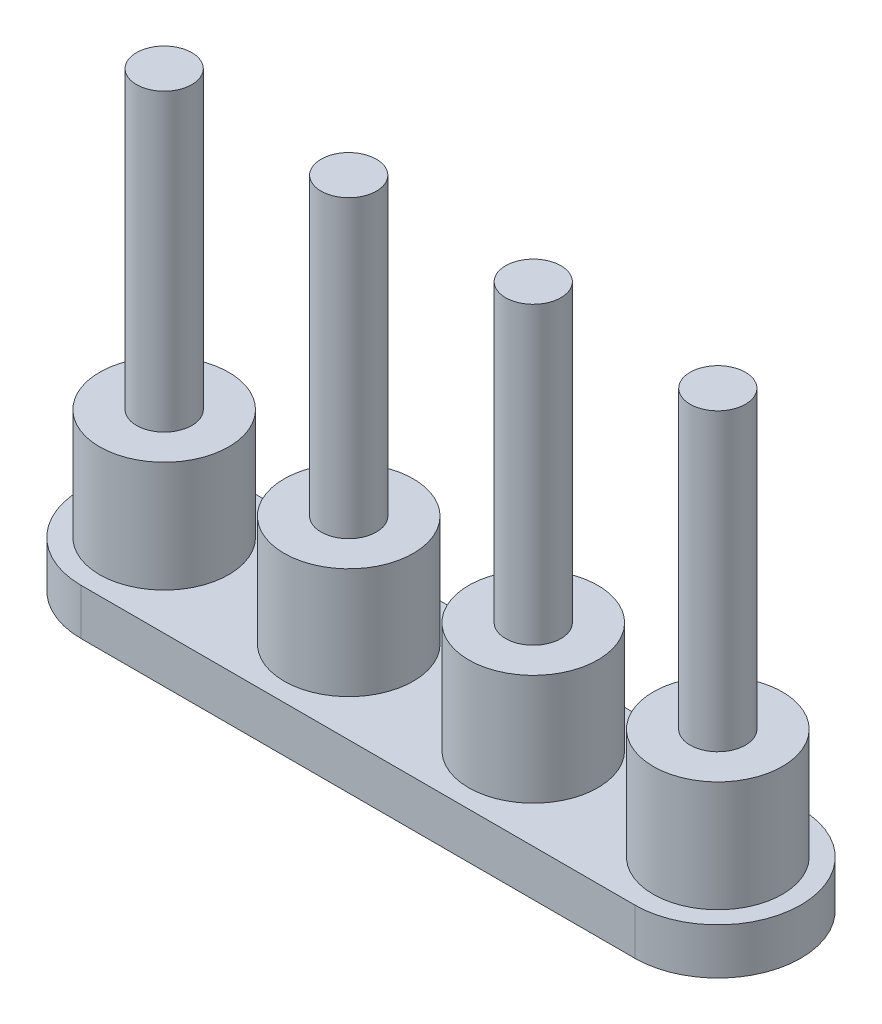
ISO-10303-21;
HEADER;
FILE_DESCRIPTION(('STEP AP214'),'2;1');
FILE_NAME('part.step','',(''),(''),'','','');
FILE_SCHEMA(('AUTOMOTIVE_DESIGN { 1 0 10303 214 1 1 1 1 }'));
ENDSEC;
DATA;
#1=APPLICATION_CONTEXT('core data for automotive mechanical design processes');
#2=APPLICATION_PROTOCOL_DEFINITION('international standard','automotive_design',2000,#1);
#3=PRODUCT_CONTEXT('',#1,'mechanical');
#4=PRODUCT('Part','Part','',(#3));
#5=PRODUCT_RELATED_PRODUCT_CATEGORY('part','',(#4));
#6=PRODUCT_DEFINITION_FORMATION('','',#4);
#7=PRODUCT_DEFINITION_CONTEXT('part definition',#1,'design');
#8=PRODUCT_DEFINITION('design','',#6,#7);
#9=PRODUCT_DEFINITION_SHAPE('','',#8);
#10=(LENGTH_UNIT() NAMED_UNIT(*) SI_UNIT(.MILLI.,.METRE.));
#11=(NAMED_UNIT(*) PLANE_ANGLE_UNIT() SI_UNIT($,.RADIAN.));
#12=(NAMED_UNIT(*) SI_UNIT($,.STERADIAN.) SOLID_ANGLE_UNIT());
#13=UNCERTAINTY_MEASURE_WITH_UNIT(LENGTH_MEASURE(1.E-05),#10,'distance_accuracy_value','');
#14=(GEOMETRIC_REPRESENTATION_CONTEXT(3) GLOBAL_UNCERTAINTY_ASSIGNED_CONTEXT((#13)) GLOBAL_UNIT_ASSIGNED_CONTEXT((#10,
#11,#12)) REPRESENTATION_CONTEXT('',''));
#15=CARTESIAN_POINT('',(0.,0.,0.));
#16=DIRECTION('',(0.,0.,1.));
#17=DIRECTION('',(1.,0.,0.));
#18=AXIS2_PLACEMENT_3D('',#15,#16,#17);
#19=CARTESIAN_POINT('',(15.,8.5,0.));
#20=DIRECTION('',(0.,1.,0.));
#21=DIRECTION('',(0.,0.,1.));
#22=AXIS2_PLACEMENT_3D('',#19,#20,#21);
#23=PLANE('',#22);
#24=CARTESIAN_POINT('',(15.,8.5,0.));
#25=DIRECTION('',(0.,1.,0.));
#26=DIRECTION('',(0.,0.,1.));
#27=AXIS2_PLACEMENT_3D('',#24,#25,#26);
#28=CIRCLE('',#27,3.5);
#29=CARTESIAN_POINT('',(15.,8.5,3.5));
#30=VERTEX_POINT('',#29);
#31=EDGE_CURVE('E155',#30,#30,#28,.T.);
#32=ORIENTED_EDGE('',*,*,#31,.T.);
#33=EDGE_LOOP('',(#32));
#34=FACE_BOUND('',#33,.T.);
#35=CARTESIAN_POINT('',(15.,8.5,0.));
#36=DIRECTION('',(0.,1.,0.));
#37=DIRECTION('',(0.,0.,1.));
#38=AXIS2_PLACEMENT_3D('',#35,#36,#37);
#39=CIRCLE('',#38,1.5);
#40=CARTESIAN_POINT('',(15.,8.5,1.5));
#41=VERTEX_POINT('',#40);
#42=EDGE_CURVE('E112',#41,#41,#39,.T.);
#43=ORIENTED_EDGE('',*,*,#42,.F.);
#44=EDGE_LOOP('',(#43));
#45=FACE_BOUND('',#44,.T.);
#46=ADVANCED_FACE('F33',(#34,#45),#23,.T.);
#47=CARTESIAN_POINT('',(-15.,2.5,-4.5));
#48=DIRECTION('',(0.,0.,1.));
#49=DIRECTION('',(1.,0.,0.));
#50=AXIS2_PLACEMENT_3D('',#47,#48,#49);
#51=PLANE('',#50);
#52=DIRECTION('',(-1.,0.,0.));
#53=VECTOR('',#52,1.);
#54=CARTESIAN_POINT('',(-15.,2.5,-4.5));
#55=LINE('',#54,#53);
#56=CARTESIAN_POINT('',(-2.9999803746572,2.5,-4.5));
#57=VERTEX_POINT('',#56);
#58=CARTESIAN_POINT('',(-15.,2.5,-4.5));
#59=VERTEX_POINT('',#58);
#60=EDGE_CURVE('E48',#57,#59,#55,.T.);
#61=ORIENTED_EDGE('',*,*,#60,.F.);
#62=DIRECTION('',(0.,-1.,0.));
#63=VECTOR('',#62,1.);
#64=CARTESIAN_POINT('',(-2.9999803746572,2.5,-4.5));
#65=LINE('',#64,#63);
#66=CARTESIAN_POINT('',(-2.9999803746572,0.,-4.5));
#67=VERTEX_POINT('',#66);
#68=EDGE_CURVE('E99',#57,#67,#65,.T.);
#69=ORIENTED_EDGE('',*,*,#68,.T.);
#70=DIRECTION('',(-1.,0.,0.));
#71=VECTOR('',#70,1.);
#72=CARTESIAN_POINT('',(-15.,0.,-4.5));
#73=LINE('',#72,#71);
#74=CARTESIAN_POINT('',(-15.,0.,-4.5));
#75=VERTEX_POINT('',#74);
#76=EDGE_CURVE('E88',#67,#75,#73,.T.);
#77=ORIENTED_EDGE('',*,*,#76,.T.);
#78=DIRECTION('',(0.,-1.,0.));
#79=VECTOR('',#78,1.);
#80=CARTESIAN_POINT('',(-15.,2.5,-4.5));
#81=LINE('',#80,#79);
#82=EDGE_CURVE('E171',#59,#75,#81,.T.);
#83=ORIENTED_EDGE('',*,*,#82,.F.);
#84=EDGE_LOOP('',(#61,#69,#77,#83));
#85=FACE_BOUND('',#84,.T.);
#86=ADVANCED_FACE('F100',(#85),#51,.F.);
#87=CARTESIAN_POINT('',(-15.,8.5,0.));
#88=DIRECTION('',(0.,1.,0.));
#89=DIRECTION('',(0.,0.,1.));
#90=AXIS2_PLACEMENT_3D('',#87,#88,#89);
#91=PLANE('',#90);
#92=CARTESIAN_POINT('',(-15.,8.5,0.));
#93=DIRECTION('',(0.,1.,0.));
#94=DIRECTION('',(0.,0.,1.));
#95=AXIS2_PLACEMENT_3D('',#92,#93,#94);
#96=CIRCLE('',#95,3.5);
#97=CARTESIAN_POINT('',(-15.,8.5,3.5));
#98=VERTEX_POINT('',#97);
#99=EDGE_CURVE('E149',#98,#98,#96,.T.);
#100=ORIENTED_EDGE('',*,*,#99,.T.);
#101=EDGE_LOOP('',(#100));
#102=FACE_BOUND('',#101,.T.);
#103=CARTESIAN_POINT('',(-15.,8.5,0.));
#104=DIRECTION('',(0.,1.,0.));
#105=DIRECTION('',(0.,0.,1.));
#106=AXIS2_PLACEMENT_3D('',#103,#104,#105);
#107=CIRCLE('',#106,1.5);
#108=CARTESIAN_POINT('',(-15.,8.5,1.5));
#109=VERTEX_POINT('',#108);
#110=EDGE_CURVE('E104',#109,#109,#107,.T.);
#111=ORIENTED_EDGE('',*,*,#110,.F.);
#112=EDGE_LOOP('',(#111));
#113=FACE_BOUND('',#112,.T.);
#114=ADVANCED_FACE('F205',(#102,#113),#91,.T.);
#115=CARTESIAN_POINT('',(-5.,8.5,0.));
#116=DIRECTION('',(0.,1.,0.));
#117=DIRECTION('',(0.,0.,1.));
#118=AXIS2_PLACEMENT_3D('',#115,#116,#117);
#119=PLANE('',#118);
#120=CARTESIAN_POINT('',(-5.,8.5,0.));
#121=DIRECTION('',(0.,1.,0.));
#122=DIRECTION('',(0.,0.,1.));
#123=AXIS2_PLACEMENT_3D('',#120,#121,#122);
#124=CIRCLE('',#123,3.5);
#125=CARTESIAN_POINT('',(-5.,8.5,3.5));
#126=VERTEX_POINT('',#125);
#127=EDGE_CURVE('E137',#126,#126,#124,.T.);
#128=ORIENTED_EDGE('',*,*,#127,.T.);
#129=EDGE_LOOP('',(#128));
#130=FACE_BOUND('',#129,.T.);
#131=CARTESIAN_POINT('',(-5.,8.5,0.));
#132=DIRECTION('',(0.,1.,0.));
#133=DIRECTION('',(0.,0.,1.));
#134=AXIS2_PLACEMENT_3D('',#131,#132,#133);
#135=CIRCLE('',#134,1.5);
#136=CARTESIAN_POINT('',(-5.,8.5,1.5));
#137=VERTEX_POINT('',#136);
#138=EDGE_CURVE('E122',#137,#137,#135,.T.);
#139=ORIENTED_EDGE('',*,*,#138,.F.);
#140=EDGE_LOOP('',(#139));
#141=FACE_BOUND('',#140,.T.);
#142=ADVANCED_FACE('F369',(#130,#141),#119,.T.);
#143=CARTESIAN_POINT('',(5.,8.5,0.));
#144=DIRECTION('',(0.,1.,0.));
#145=DIRECTION('',(0.,0.,1.));
#146=AXIS2_PLACEMENT_3D('',#143,#144,#145);
#147=PLANE('',#146);
#148=CARTESIAN_POINT('',(5.,8.5,0.));
#149=DIRECTION('',(0.,1.,0.));
#150=DIRECTION('',(0.,0.,1.));
#151=AXIS2_PLACEMENT_3D('',#148,#149,#150);
#152=CIRCLE('',#151,3.5);
#153=CARTESIAN_POINT('',(5.,8.5,3.5));
#154=VERTEX_POINT('',#153);
#155=EDGE_CURVE('E143',#154,#154,#152,.T.);
#156=ORIENTED_EDGE('',*,*,#155,.T.);
#157=EDGE_LOOP('',(#156));
#158=FACE_BOUND('',#157,.T.);
#159=CARTESIAN_POINT('',(5.,8.5,0.));
#160=DIRECTION('',(0.,1.,0.));
#161=DIRECTION('',(0.,0.,1.));
#162=AXIS2_PLACEMENT_3D('',#159,#160,#161);
#163=CIRCLE('',#162,1.5);
#164=CARTESIAN_POINT('',(5.,8.5,1.5));
#165=VERTEX_POINT('',#164);
#166=EDGE_CURVE('E128',#165,#165,#163,.T.);
#167=ORIENTED_EDGE('',*,*,#166,.F.);
#168=EDGE_LOOP('',(#167));
#169=FACE_BOUND('',#168,.T.);
#170=ADVANCED_FACE('F196',(#158,#169),#147,.T.);
#171=CARTESIAN_POINT('',(-15.,2.5,0.));
#172=DIRECTION('',(0.,1.,0.));
#173=DIRECTION('',(0.,0.,1.));
#174=AXIS2_PLACEMENT_3D('',#171,#172,#173);
#175=PLANE('',#174);
#176=CARTESIAN_POINT('',(5.,2.5,0.));
#177=DIRECTION('',(0.,1.,0.));
#178=DIRECTION('',(0.,0.,1.));
#179=AXIS2_PLACEMENT_3D('',#176,#177,#178);
#180=CIRCLE('',#179,3.5);
#181=CARTESIAN_POINT('',(5.,2.5,3.5));
#182=VERTEX_POINT('',#181);
#183=EDGE_CURVE('E140',#182,#182,#180,.T.);
#184=ORIENTED_EDGE('',*,*,#183,.F.);
#185=EDGE_LOOP('',(#184));
#186=FACE_BOUND('',#185,.T.);
#187=CARTESIAN_POINT('',(15.,2.5,0.));
#188=DIRECTION('',(0.,1.,0.));
#189=DIRECTION('',(0.,0.,1.));
#190=AXIS2_PLACEMENT_3D('',#187,#188,#189);
#191=CIRCLE('',#190,3.5);
#192=CARTESIAN_POINT('',(15.,2.5,3.5));
#193=VERTEX_POINT('',#192);
#194=EDGE_CURVE('E152',#193,#193,#191,.T.);
#195=ORIENTED_EDGE('',*,*,#194,.F.);
#196=EDGE_LOOP('',(#195));
#197=FACE_BOUND('',#196,.T.);
#198=CARTESIAN_POINT('',(-15.,2.5,0.));
#199=DIRECTION('',(0.,1.,0.));
#200=DIRECTION('',(0.,0.,1.));
#201=AXIS2_PLACEMENT_3D('',#198,#199,#200);
#202=CIRCLE('',#201,4.5);
#203=CARTESIAN_POINT('',(-15.,2.5,4.5));
#204=VERTEX_POINT('',#203);
#205=EDGE_CURVE('E162',#59,#204,#202,.T.);
#206=ORIENTED_EDGE('',*,*,#205,.T.);
#207=DIRECTION('',(1.,0.,0.));
#208=VECTOR('',#207,1.);
#209=CARTESIAN_POINT('',(-15.,2.5,4.5));
#210=LINE('',#209,#208);
#211=CARTESIAN_POINT('',(15.,2.5,4.5));
#212=VERTEX_POINT('',#211);
#213=EDGE_CURVE('E165',#204,#212,#210,.T.);
#214=ORIENTED_EDGE('',*,*,#213,.T.);
#215=CARTESIAN_POINT('',(15.,2.5,0.));
#216=DIRECTION('',(0.,1.,0.));
#217=DIRECTION('',(0.,0.,-1.));
#218=AXIS2_PLACEMENT_3D('',#215,#216,#217);
#219=CIRCLE('',#218,4.5);
#220=CARTESIAN_POINT('',(15.,2.5,-4.5));
#221=VERTEX_POINT('',#220);
#222=EDGE_CURVE('E167',#212,#221,#219,.T.);
#223=ORIENTED_EDGE('',*,*,#222,.T.);
#224=CARTESIAN_POINT('',(2.9999803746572,2.5,-4.5));
#225=VERTEX_POINT('',#224);
#226=EDGE_CURVE('E169',#221,#225,#55,.T.);
#227=ORIENTED_EDGE('',*,*,#226,.T.);
#228=CARTESIAN_POINT('',(0.,2.5,-4.51085134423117));
#229=DIRECTION('',(0.,-1.,0.));
#230=DIRECTION('',(0.,0.,1.));
#231=AXIS2_PLACEMENT_3D('',#228,#229,#230);
#232=CIRCLE('',#231,3.);
#233=EDGE_CURVE('E107',#57,#225,#232,.T.);
#234=ORIENTED_EDGE('',*,*,#233,.F.);
#235=ORIENTED_EDGE('',*,*,#60,.T.);
#236=EDGE_LOOP('',(#206,#214,#223,#227,#234,#235));
#237=FACE_BOUND('',#236,.T.);
#238=CARTESIAN_POINT('',(-15.,2.5,0.));
#239=DIRECTION('',(0.,1.,0.));
#240=DIRECTION('',(0.,0.,1.));
#241=AXIS2_PLACEMENT_3D('',#238,#239,#240);
#242=CIRCLE('',#241,3.5);
#243=CARTESIAN_POINT('',(-15.,2.5,3.5));
#244=VERTEX_POINT('',#243);
#245=EDGE_CURVE('E146',#244,#244,#242,.T.);
#246=ORIENTED_EDGE('',*,*,#245,.F.);
#247=EDGE_LOOP('',(#246));
#248=FACE_BOUND('',#247,.T.);
#249=CARTESIAN_POINT('',(-5.,2.5,0.));
#250=DIRECTION('',(0.,1.,0.));
#251=DIRECTION('',(0.,0.,1.));
#252=AXIS2_PLACEMENT_3D('',#249,#250,#251);
#253=CIRCLE('',#252,3.5);
#254=CARTESIAN_POINT('',(-5.,2.5,3.5));
#255=VERTEX_POINT('',#254);
#256=EDGE_CURVE('E134',#255,#255,#253,.T.);
#257=ORIENTED_EDGE('',*,*,#256,.F.);
#258=EDGE_LOOP('',(#257));
#259=FACE_BOUND('',#258,.T.);
#260=ADVANCED_FACE('F185',(#186,#197,#237,#248,#259),#175,.T.);
#261=CARTESIAN_POINT('',(-15.,2.5,0.));
#262=DIRECTION('',(0.,-1.,0.));
#263=DIRECTION('',(0.,0.,-1.));
#264=AXIS2_PLACEMENT_3D('',#261,#262,#263);
#265=CYLINDRICAL_SURFACE('',#264,4.5);
#266=CARTESIAN_POINT('',(-15.,0.,0.));
#267=DIRECTION('',(0.,1.,0.));
#268=DIRECTION('',(0.,0.,1.));
#269=AXIS2_PLACEMENT_3D('',#266,#267,#268);
#270=CIRCLE('',#269,4.5);
#271=CARTESIAN_POINT('',(-15.,0.,4.5));
#272=VERTEX_POINT('',#271);
#273=EDGE_CURVE('E94',#75,#272,#270,.T.);
#274=ORIENTED_EDGE('',*,*,#273,.T.);
#275=DIRECTION('',(0.,-1.,0.));
#276=VECTOR('',#275,1.);
#277=CARTESIAN_POINT('',(-15.,2.5,4.5));
#278=LINE('',#277,#276);
#279=EDGE_CURVE('E11',#204,#272,#278,.T.);
#280=ORIENTED_EDGE('',*,*,#279,.F.);
#281=ORIENTED_EDGE('',*,*,#205,.F.);
#282=ORIENTED_EDGE('',*,*,#82,.T.);
#283=EDGE_LOOP('',(#274,#280,#281,#282));
#284=FACE_BOUND('',#283,.T.);
#285=ADVANCED_FACE('F35',(#284),#265,.T.);
#286=CARTESIAN_POINT('',(-15.,2.5,4.5));
#287=DIRECTION('',(0.,0.,-1.));
#288=DIRECTION('',(-1.,0.,0.));
#289=AXIS2_PLACEMENT_3D('',#286,#287,#288);
#290=PLANE('',#289);
#291=DIRECTION('',(1.,0.,0.));
#292=VECTOR('',#291,1.);
#293=CARTESIAN_POINT('',(-15.,0.,4.5));
#294=LINE('',#293,#292);
#295=CARTESIAN_POINT('',(15.,0.,4.5));
#296=VERTEX_POINT('',#295);
#297=EDGE_CURVE('E159',#272,#296,#294,.T.);
#298=ORIENTED_EDGE('',*,*,#297,.T.);
#299=DIRECTION('',(0.,-1.,0.));
#300=VECTOR('',#299,1.);
#301=CARTESIAN_POINT('',(15.,2.5,4.5));
#302=LINE('',#301,#300);
#303=EDGE_CURVE('E41',#212,#296,#302,.T.);
#304=ORIENTED_EDGE('',*,*,#303,.F.);
#305=ORIENTED_EDGE('',*,*,#213,.F.);
#306=ORIENTED_EDGE('',*,*,#279,.T.);
#307=EDGE_LOOP('',(#298,#304,#305,#306));
#308=FACE_BOUND('',#307,.T.);
#309=ADVANCED_FACE('F189',(#308),#290,.F.);
#310=CARTESIAN_POINT('',(15.,2.5,0.));
#311=DIRECTION('',(0.,-1.,0.));
#312=DIRECTION('',(0.,0.,-1.));
#313=AXIS2_PLACEMENT_3D('',#310,#311,#312);
#314=CYLINDRICAL_SURFACE('',#313,4.5);
#315=CARTESIAN_POINT('',(15.,0.,0.));
#316=DIRECTION('',(0.,1.,0.));
#317=DIRECTION('',(0.,0.,-1.));
#318=AXIS2_PLACEMENT_3D('',#315,#316,#317);
#319=CIRCLE('',#318,4.5);
#320=CARTESIAN_POINT('',(15.,0.,-4.5));
#321=VERTEX_POINT('',#320);
#322=EDGE_CURVE('E97',#296,#321,#319,.T.);
#323=ORIENTED_EDGE('',*,*,#322,.T.);
#324=DIRECTION('',(0.,-1.,0.));
#325=VECTOR('',#324,1.);
#326=CARTESIAN_POINT('',(15.,2.5,-4.5));
#327=LINE('',#326,#325);
#328=EDGE_CURVE('E173',#221,#321,#327,.T.);
#329=ORIENTED_EDGE('',*,*,#328,.F.);
#330=ORIENTED_EDGE('',*,*,#222,.F.);
#331=ORIENTED_EDGE('',*,*,#303,.T.);
#332=EDGE_LOOP('',(#323,#329,#330,#331));
#333=FACE_BOUND('',#332,.T.);
#334=ADVANCED_FACE('F180',(#333),#314,.T.);
#335=CARTESIAN_POINT('',(2.9999803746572,0.,-4.5));
#336=VERTEX_POINT('',#335);
#337=EDGE_CURVE('E96',#321,#336,#73,.T.);
#338=ORIENTED_EDGE('',*,*,#337,.T.);
#339=DIRECTION('',(0.,-1.,0.));
#340=VECTOR('',#339,1.);
#341=CARTESIAN_POINT('',(2.9999803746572,2.5,-4.5));
#342=LINE('',#341,#340);
#343=EDGE_CURVE('E56',#225,#336,#342,.T.);
#344=ORIENTED_EDGE('',*,*,#343,.F.);
#345=ORIENTED_EDGE('',*,*,#226,.F.);
#346=ORIENTED_EDGE('',*,*,#328,.T.);
#347=EDGE_LOOP('',(#338,#344,#345,#346));
#348=FACE_BOUND('',#347,.T.);
#349=ADVANCED_FACE('F183',(#348),#51,.F.);
#350=CARTESIAN_POINT('',(-15.,0.,0.));
#351=DIRECTION('',(0.,1.,0.));
#352=DIRECTION('',(0.,0.,1.));
#353=AXIS2_PLACEMENT_3D('',#350,#351,#352);
#354=PLANE('',#353);
#355=ORIENTED_EDGE('',*,*,#273,.F.);
#356=ORIENTED_EDGE('',*,*,#76,.F.);
#357=CARTESIAN_POINT('',(0.,0.,-4.51085134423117));
#358=DIRECTION('',(0.,-1.,0.));
#359=DIRECTION('',(0.,0.,1.));
#360=AXIS2_PLACEMENT_3D('',#357,#358,#359);
#361=CIRCLE('',#360,3.);
#362=EDGE_CURVE('E92',#67,#336,#361,.T.);
#363=ORIENTED_EDGE('',*,*,#362,.T.);
#364=ORIENTED_EDGE('',*,*,#337,.F.);
#365=ORIENTED_EDGE('',*,*,#322,.F.);
#366=ORIENTED_EDGE('',*,*,#297,.F.);
#367=EDGE_LOOP('',(#355,#356,#363,#364,#365,#366));
#368=FACE_BOUND('',#367,.T.);
#369=ADVANCED_FACE('F89',(#368),#354,.F.);
#370=CARTESIAN_POINT('',(15.,8.5,0.));
#371=DIRECTION('',(0.,-1.,0.));
#372=DIRECTION('',(0.,0.,-1.));
#373=AXIS2_PLACEMENT_3D('',#370,#371,#372);
#374=CYLINDRICAL_SURFACE('',#373,3.5);
#375=ORIENTED_EDGE('',*,*,#31,.F.);
#376=EDGE_LOOP('',(#375));
#377=FACE_BOUND('',#376,.T.);
#378=ORIENTED_EDGE('',*,*,#194,.T.);
#379=EDGE_LOOP('',(#378));
#380=FACE_BOUND('',#379,.T.);
#381=ADVANCED_FACE('F212',(#377,#380),#374,.T.);
#382=CARTESIAN_POINT('',(-15.,8.5,0.));
#383=DIRECTION('',(0.,-1.,0.));
#384=DIRECTION('',(0.,0.,-1.));
#385=AXIS2_PLACEMENT_3D('',#382,#383,#384);
#386=CYLINDRICAL_SURFACE('',#385,3.5);
#387=ORIENTED_EDGE('',*,*,#99,.F.);
#388=EDGE_LOOP('',(#387));
#389=FACE_BOUND('',#388,.T.);
#390=ORIENTED_EDGE('',*,*,#245,.T.);
#391=EDGE_LOOP('',(#390));
#392=FACE_BOUND('',#391,.T.);
#393=ADVANCED_FACE('F210',(#389,#392),#386,.T.);
#394=CARTESIAN_POINT('',(5.,8.5,0.));
#395=DIRECTION('',(0.,-1.,0.));
#396=DIRECTION('',(0.,0.,-1.));
#397=AXIS2_PLACEMENT_3D('',#394,#395,#396);
#398=CYLINDRICAL_SURFACE('',#397,3.5);
#399=ORIENTED_EDGE('',*,*,#155,.F.);
#400=EDGE_LOOP('',(#399));
#401=FACE_BOUND('',#400,.T.);
#402=ORIENTED_EDGE('',*,*,#183,.T.);
#403=EDGE_LOOP('',(#402));
#404=FACE_BOUND('',#403,.T.);
#405=ADVANCED_FACE('F244',(#401,#404),#398,.T.);
#406=CARTESIAN_POINT('',(-5.,8.5,0.));
#407=DIRECTION('',(0.,-1.,0.));
#408=DIRECTION('',(0.,0.,-1.));
#409=AXIS2_PLACEMENT_3D('',#406,#407,#408);
#410=CYLINDRICAL_SURFACE('',#409,3.5);
#411=ORIENTED_EDGE('',*,*,#127,.F.);
#412=EDGE_LOOP('',(#411));
#413=FACE_BOUND('',#412,.T.);
#414=ORIENTED_EDGE('',*,*,#256,.T.);
#415=EDGE_LOOP('',(#414));
#416=FACE_BOUND('',#415,.T.);
#417=ADVANCED_FACE('F251',(#413,#416),#410,.T.);
#418=CARTESIAN_POINT('',(5.,24.5,0.));
#419=DIRECTION('',(0.,-1.,0.));
#420=DIRECTION('',(0.,0.,-1.));
#421=AXIS2_PLACEMENT_3D('',#418,#419,#420);
#422=CYLINDRICAL_SURFACE('',#421,1.5);
#423=CARTESIAN_POINT('',(5.,24.5,0.));
#424=DIRECTION('',(0.,1.,0.));
#425=DIRECTION('',(0.,0.,1.));
#426=AXIS2_PLACEMENT_3D('',#423,#424,#425);
#427=CIRCLE('',#426,1.5);
#428=CARTESIAN_POINT('',(5.,24.5,1.5));
#429=VERTEX_POINT('',#428);
#430=EDGE_CURVE('E131',#429,#429,#427,.T.);
#431=ORIENTED_EDGE('',*,*,#430,.F.);
#432=EDGE_LOOP('',(#431));
#433=FACE_BOUND('',#432,.T.);
#434=ORIENTED_EDGE('',*,*,#166,.T.);
#435=EDGE_LOOP('',(#434));
#436=FACE_BOUND('',#435,.T.);
#437=ADVANCED_FACE('F259',(#433,#436),#422,.T.);
#438=CARTESIAN_POINT('',(5.,24.5,0.));
#439=DIRECTION('',(0.,1.,0.));
#440=DIRECTION('',(0.,0.,1.));
#441=AXIS2_PLACEMENT_3D('',#438,#439,#440);
#442=PLANE('',#441);
#443=ORIENTED_EDGE('',*,*,#430,.T.);
#444=EDGE_LOOP('',(#443));
#445=FACE_BOUND('',#444,.T.);
#446=ADVANCED_FACE('F268',(#445),#442,.T.);
#447=CARTESIAN_POINT('',(-5.,24.5,0.));
#448=DIRECTION('',(0.,-1.,0.));
#449=DIRECTION('',(0.,0.,-1.));
#450=AXIS2_PLACEMENT_3D('',#447,#448,#449);
#451=CYLINDRICAL_SURFACE('',#450,1.5);
#452=CARTESIAN_POINT('',(-5.,24.5,0.));
#453=DIRECTION('',(0.,1.,0.));
#454=DIRECTION('',(0.,0.,1.));
#455=AXIS2_PLACEMENT_3D('',#452,#453,#454);
#456=CIRCLE('',#455,1.5);
#457=CARTESIAN_POINT('',(-5.,24.5,1.5));
#458=VERTEX_POINT('',#457);
#459=EDGE_CURVE('E125',#458,#458,#456,.T.);
#460=ORIENTED_EDGE('',*,*,#459,.F.);
#461=EDGE_LOOP('',(#460));
#462=FACE_BOUND('',#461,.T.);
#463=ORIENTED_EDGE('',*,*,#138,.T.);
#464=EDGE_LOOP('',(#463));
#465=FACE_BOUND('',#464,.T.);
#466=ADVANCED_FACE('F276',(#462,#465),#451,.T.);
#467=CARTESIAN_POINT('',(-5.,24.5,0.));
#468=DIRECTION('',(0.,1.,0.));
#469=DIRECTION('',(0.,0.,1.));
#470=AXIS2_PLACEMENT_3D('',#467,#468,#469);
#471=PLANE('',#470);
#472=ORIENTED_EDGE('',*,*,#459,.T.);
#473=EDGE_LOOP('',(#472));
#474=FACE_BOUND('',#473,.T.);
#475=ADVANCED_FACE('F285',(#474),#471,.T.);
#476=CARTESIAN_POINT('',(-15.,24.5,0.));
#477=DIRECTION('',(0.,-1.,0.));
#478=DIRECTION('',(0.,0.,-1.));
#479=AXIS2_PLACEMENT_3D('',#476,#477,#478);
#480=CYLINDRICAL_SURFACE('',#479,1.5);
#481=CARTESIAN_POINT('',(-15.,24.5,0.));
#482=DIRECTION('',(0.,1.,0.));
#483=DIRECTION('',(0.,0.,1.));
#484=AXIS2_PLACEMENT_3D('',#481,#482,#483);
#485=CIRCLE('',#484,1.5);
#486=CARTESIAN_POINT('',(-15.,24.5,1.5));
#487=VERTEX_POINT('',#486);
#488=EDGE_CURVE('E119',#487,#487,#485,.T.);
#489=ORIENTED_EDGE('',*,*,#488,.F.);
#490=EDGE_LOOP('',(#489));
#491=FACE_BOUND('',#490,.T.);
#492=ORIENTED_EDGE('',*,*,#110,.T.);
#493=EDGE_LOOP('',(#492));
#494=FACE_BOUND('',#493,.T.);
#495=ADVANCED_FACE('F293',(#491,#494),#480,.T.);
#496=CARTESIAN_POINT('',(-15.,24.5,0.));
#497=DIRECTION('',(0.,1.,0.));
#498=DIRECTION('',(0.,0.,1.));
#499=AXIS2_PLACEMENT_3D('',#496,#497,#498);
#500=PLANE('',#499);
#501=ORIENTED_EDGE('',*,*,#488,.T.);
#502=EDGE_LOOP('',(#501));
#503=FACE_BOUND('',#502,.T.);
#504=ADVANCED_FACE('F302',(#503),#500,.T.);
#505=CARTESIAN_POINT('',(0.,2.5,-4.51085134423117));
#506=DIRECTION('',(0.,-1.,0.));
#507=DIRECTION('',(0.,0.,-1.));
#508=AXIS2_PLACEMENT_3D('',#505,#506,#507);
#509=CYLINDRICAL_SURFACE('',#508,3.);
#510=ORIENTED_EDGE('',*,*,#362,.F.);
#511=ORIENTED_EDGE('',*,*,#68,.F.);
#512=ORIENTED_EDGE('',*,*,#233,.T.);
#513=ORIENTED_EDGE('',*,*,#343,.T.);
#514=EDGE_LOOP('',(#510,#511,#512,#513));
#515=FACE_BOUND('',#514,.T.);
#516=ADVANCED_FACE('F106',(#515),#509,.T.);
#517=CARTESIAN_POINT('',(15.,24.5,0.));
#518=DIRECTION('',(0.,-1.,0.));
#519=DIRECTION('',(0.,0.,-1.));
#520=AXIS2_PLACEMENT_3D('',#517,#518,#519);
#521=CYLINDRICAL_SURFACE('',#520,1.5);
#522=CARTESIAN_POINT('',(15.,24.5,0.));
#523=DIRECTION('',(0.,1.,0.));
#524=DIRECTION('',(0.,0.,1.));
#525=AXIS2_PLACEMENT_3D('',#522,#523,#524);
#526=CIRCLE('',#525,1.5);
#527=CARTESIAN_POINT('',(15.,24.5,1.5));
#528=VERTEX_POINT('',#527);
#529=EDGE_CURVE('E108',#528,#528,#526,.T.);
#530=ORIENTED_EDGE('',*,*,#529,.F.);
#531=EDGE_LOOP('',(#530));
#532=FACE_BOUND('',#531,.T.);
#533=ORIENTED_EDGE('',*,*,#42,.T.);
#534=EDGE_LOOP('',(#533));
#535=FACE_BOUND('',#534,.T.);
#536=ADVANCED_FACE('F317',(#532,#535),#521,.T.);
#537=CARTESIAN_POINT('',(15.,24.5,0.));
#538=DIRECTION('',(0.,1.,0.));
#539=DIRECTION('',(0.,0.,1.));
#540=AXIS2_PLACEMENT_3D('',#537,#538,#539);
#541=PLANE('',#540);
#542=ORIENTED_EDGE('',*,*,#529,.T.);
#543=EDGE_LOOP('',(#542));
#544=FACE_BOUND('',#543,.T.);
#545=ADVANCED_FACE('F324',(#544),#541,.T.);
#546=CLOSED_SHELL('',(#46,#86,#114,#142,#170,#260,#285,#309,#334,#349,#369,#381,#393,#405,#417,
#437,#446,#466,#475,#495,#504,#516,#536,#545));
#547=MANIFOLD_SOLID_BREP('B2',#546);
#548=ADVANCED_BREP_SHAPE_REPRESENTATION('',(#18,#547),#14);
#549=SHAPE_DEFINITION_REPRESENTATION(#9,#548);
ENDSEC;
END-ISO-10303-21;
